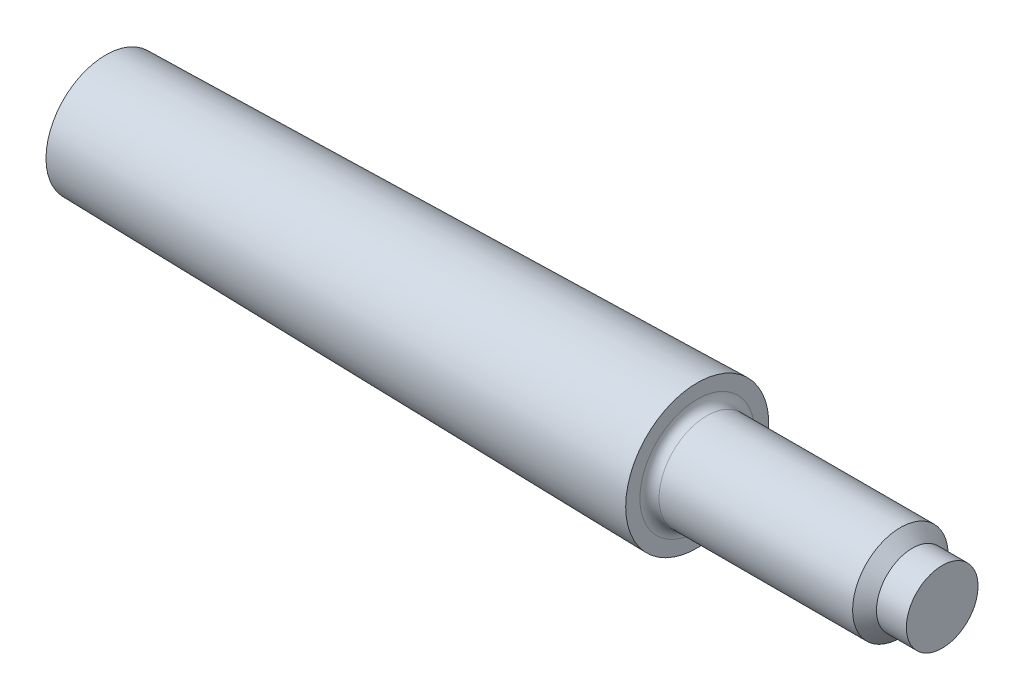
from build123d import *

# Parameters (mm, degrees)
FILLET1_R = 1.6


with BuildPart() as part:
    # BodySke → BaseBody (revolve)
    with BuildSketch(Plane.XY, mode=Mode.PRIVATE) as basebody_sk:
        Polygon((-99, 0), (-99, 10), (0, 11.98), (0, 8), (34, 8), (36, 6), (41, 6), (41, 0), align=None)
    revolve(basebody_sk.sketch.rotate(Axis((-250, 0, 0), (1, 0, 0)), 90), axis=Axis((-250, 0, 0), (1, 0, 0)))

    # Fillet1
    fillet1_edges = [part.edges().sort_by_distance(p)[0] for p in [
        (0, 0, -8),
    ]]
    fillet(fillet1_edges, radius=FILLET1_R)


solid = part.part
